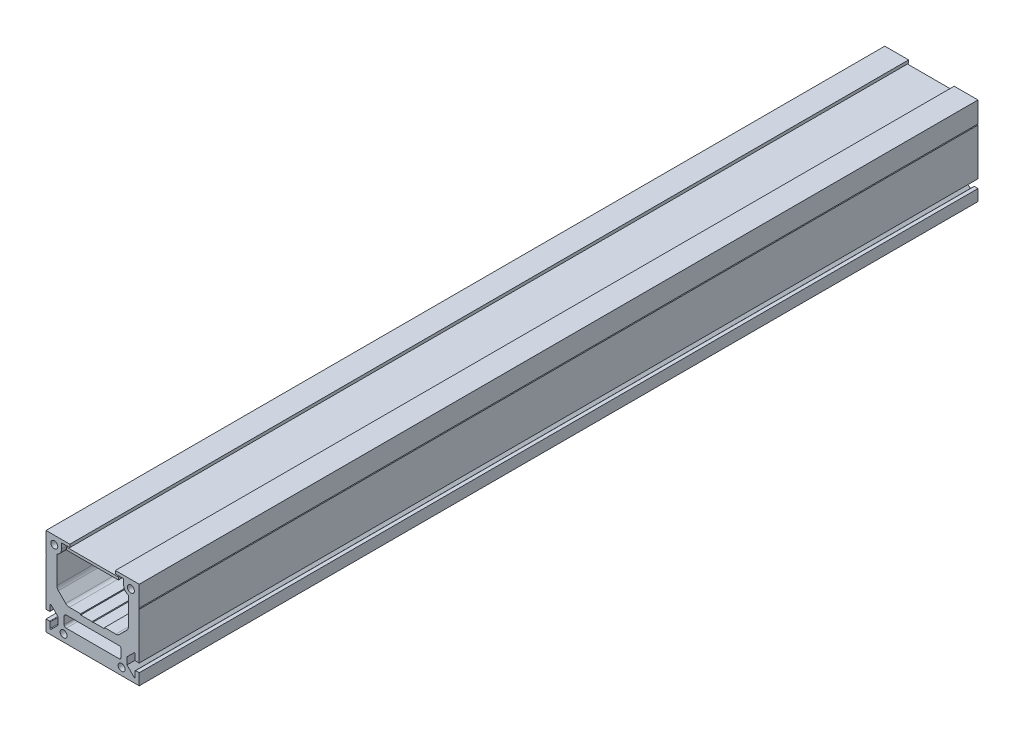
from build123d import *

# Parameters (mm, degrees)
SKIZZE1_W               = 90
SKIZZE1_H               = 85
LINEAR_AUSTRAGEN1_DEPTH = 810
LINEAR_AUSTRAGEN2_DEPTH = 816.689892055
SKIZZE3_R               = 3.35
SKIZZE3_W               = 55
SKIZZE3_H               = 11
LINEAR_AUSTRAGEN3_DEPTH = 816.689892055
SKIZZE6_W               = 44
SKIZZE6_H               = 28.927733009
LINEAR_AUSTRAGEN4_DEPTH = 816.689892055
FASE1_SIZE              = 10
VERRUNDUNG8_R           = 5
VERRUNDUNG9_R           = 2
LINEAR_AUSTRAGEN7_DEPTH = 816.689892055
LINEAR_AUSTRAGEN8_DEPTH = 816.689892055
SKIZZE11_W              = 50
SKIZZE11_H              = 2.5
LINEAR_AUSTRAGEN9_DEPTH = 810


with BuildPart() as part:
    # Skizze1 → Linear austragen1 (new body)
    with BuildSketch(Plane.XY):
        with Locations((0, 42.5)):
            Rectangle(SKIZZE1_W, SKIZZE1_H)
    extrude(amount=-LINEAR_AUSTRAGEN1_DEPTH)

    # Skizze2 → Linear austragen2 (cut, through all)
    with BuildSketch(Plane.XY):
        with BuildLine():
            Line((45, 19.05), (45, 10.95))
            Line((45, 10.95), (41.5, 10.95))
            ThreePointArc((41.5, 10.95), (41.146446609, 10.803553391), (41, 10.45))
            Line((41, 10.45), (41, 5))
            ThreePointArc((41, 5), (40.691341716, 4.538060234), (40.146446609, 4.646446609))
            Line((40.146446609, 4.646446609), (33.2, 11.592893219))
            Line((33.2, 11.592893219), (33.2, 18.407106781))
            Line((33.2, 18.407106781), (40.146446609, 25.353553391))
            ThreePointArc((40.146446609, 25.353553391), (40.691341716, 25.461939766), (41, 25))
            Line((41, 25), (41, 19.55))
            ThreePointArc((41, 19.55), (41.146446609, 19.196446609), (41.5, 19.05))
            Line((41.5, 19.05), (45, 19.05))
        make_face()
        with BuildLine():
            Line((-33.2, 18.407106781), (-33.2, 11.592893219))
            Line((-33.2, 11.592893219), (-40.146446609, 4.646446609))
            ThreePointArc((-40.146446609, 4.646446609), (-40.691341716, 4.538060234), (-41, 5))
            Line((-41, 5), (-41, 10.45))
            ThreePointArc((-41, 10.45), (-41.146446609, 10.803553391), (-41.5, 10.95))
            Line((-41.5, 10.95), (-45, 10.95))
            Line((-45, 10.95), (-45, 19.05))
            Line((-45, 19.05), (-41.5, 19.05))
            ThreePointArc((-41.5, 19.05), (-41.146446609, 19.196446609), (-41, 19.55))
            Line((-41, 19.55), (-41, 25))
            ThreePointArc((-41, 25), (-40.691341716, 25.461939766), (-40.146446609, 25.353553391))
            Line((-40.146446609, 25.353553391), (-33.2, 18.407106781))
        make_face()
    extrude(amount=-LINEAR_AUSTRAGEN2_DEPTH, mode=Mode.SUBTRACT)

    # Skizze3 → Linear austragen3 (cut, through all)
    with BuildSketch(Plane.XY):
        with Locations((28, 7)):
            Circle(SKIZZE3_R)
        with Locations((-28, 7)):
            Circle(SKIZZE3_R)
        with Locations((-37, 77)):
            Circle(SKIZZE3_R)
        with Locations((37, 77)):
            Circle(SKIZZE3_R)
        with BuildLine():
            Line((-30, 77), (-30, 82.1))
            Line((-30, 82.1), (30, 82.1))
            Line((30, 82.1), (30, 77))
            ThreePointArc((30, 77), (31.233718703, 73.031373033), (34.5, 70.461651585))
            Line((34.5, 70.461651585), (34.5, 32))
            Line((34.5, 32), (-34.5, 32))
            Line((-34.5, 32), (-34.5, 70.461651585))
            ThreePointArc((-34.5, 70.461651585), (-31.233718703, 73.031373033), (-30, 77))
        make_face()
        with Locations((0, 18.5)):
            Rectangle(SKIZZE3_W, SKIZZE3_H)
    extrude(amount=-LINEAR_AUSTRAGEN3_DEPTH, mode=Mode.SUBTRACT)

    # Skizze6 → Linear austragen4 (cut, through all)
    with BuildSketch(Plane.XY):
        with Locations((0, 79.836725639)):
            Rectangle(SKIZZE6_W, SKIZZE6_H)
    extrude(amount=-LINEAR_AUSTRAGEN4_DEPTH, mode=Mode.SUBTRACT)

    # Fase1
    fase1_edges = [part.edges().sort_by_distance(p)[0] for p in [
        (34.5, 32, -405),
        (-34.5, 32, -405),
    ]]
    chamfer(fase1_edges, length=FASE1_SIZE)

    # Verrundung8
    verrundung8_edges = [part.edges().sort_by_distance(p)[0] for p in [
        (34.5, 42, -405),
        (-24.5, 32, -405),
        (24.5, 32, -405),
        (-34.5, 42, -405),
    ]]
    fillet(verrundung8_edges, radius=VERRUNDUNG8_R)

    # Verrundung9
    verrundung9_edges = [part.edges().sort_by_distance(p)[0] for p in [
        (27.5, 24, -405),
        (27.5, 13, -405),
        (-27.5, 13, -405),
        (-27.5, 24, -405),
    ]]
    fillet(verrundung9_edges, radius=VERRUNDUNG9_R)

    # Skizze9 → Linear austragen7 (cut, through all)
    with BuildSketch(Plane.XY):
        Polygon((44.5, 64.5), (45.722657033, 65.722657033), (45.722657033, 63.277342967), align=None)
        Polygon((-45.722657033, 65.722657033), (-45.722657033, 63.277342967), (-44.5, 64.5), align=None)
    extrude(amount=-LINEAR_AUSTRAGEN7_DEPTH, mode=Mode.SUBTRACT)

    # Skizze10 → Linear austragen8 (cut, through all)
    with BuildSketch(Plane.XY):
        Polygon((-11.5, 32), (-11.5, 31), (-0.5, 31), (0, 30.5), (0.5, 31), (11.5, 31), (11.5, 32), align=None)
    extrude(amount=-LINEAR_AUSTRAGEN8_DEPTH, mode=Mode.SUBTRACT)


with BuildPart() as body_2:
    # Skizze11 → Linear austragen9 (new, through all)
    with BuildSketch(Plane.XY):
        with Locations((0, 79.75)):
            Rectangle(SKIZZE11_W, SKIZZE11_H)
    extrude(amount=-LINEAR_AUSTRAGEN9_DEPTH)


solid = Compound([part.part, body_2.part])
